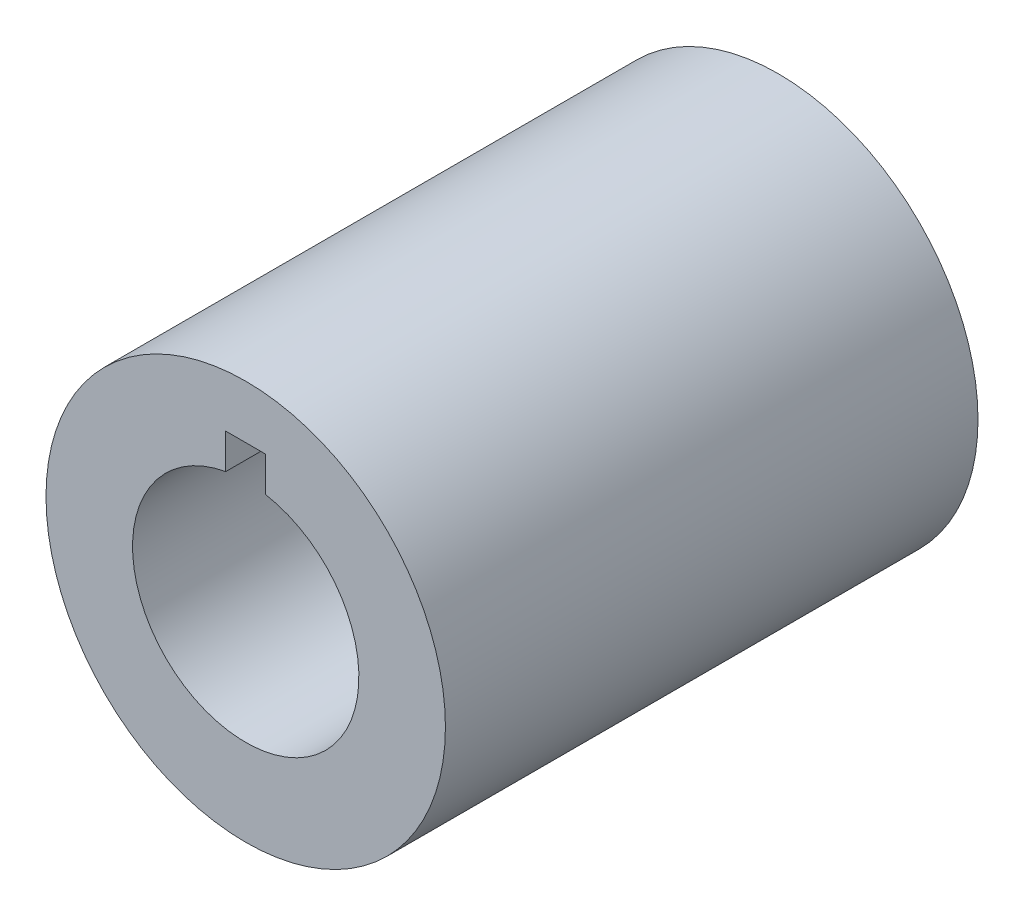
ISO-10303-21;
HEADER;
FILE_DESCRIPTION(('STEP AP214'),'2;1');
FILE_NAME('part.step','',(''),(''),'','','');
FILE_SCHEMA(('AUTOMOTIVE_DESIGN { 1 0 10303 214 1 1 1 1 }'));
ENDSEC;
DATA;
#1=APPLICATION_CONTEXT('core data for automotive mechanical design processes');
#2=APPLICATION_PROTOCOL_DEFINITION('international standard','automotive_design',2000,#1);
#3=PRODUCT_CONTEXT('',#1,'mechanical');
#4=PRODUCT('Part','Part','',(#3));
#5=PRODUCT_RELATED_PRODUCT_CATEGORY('part','',(#4));
#6=PRODUCT_DEFINITION_FORMATION('','',#4);
#7=PRODUCT_DEFINITION_CONTEXT('part definition',#1,'design');
#8=PRODUCT_DEFINITION('design','',#6,#7);
#9=PRODUCT_DEFINITION_SHAPE('','',#8);
#10=(LENGTH_UNIT() NAMED_UNIT(*) SI_UNIT(.MILLI.,.METRE.));
#11=(NAMED_UNIT(*) PLANE_ANGLE_UNIT() SI_UNIT($,.RADIAN.));
#12=(NAMED_UNIT(*) SI_UNIT($,.STERADIAN.) SOLID_ANGLE_UNIT());
#13=UNCERTAINTY_MEASURE_WITH_UNIT(LENGTH_MEASURE(1.E-05),#10,'distance_accuracy_value','');
#14=(GEOMETRIC_REPRESENTATION_CONTEXT(3) GLOBAL_UNCERTAINTY_ASSIGNED_CONTEXT((#13)) GLOBAL_UNIT_ASSIGNED_CONTEXT((#10,
#11,#12)) REPRESENTATION_CONTEXT('',''));
#15=CARTESIAN_POINT('',(0.,0.,0.));
#16=DIRECTION('',(0.,0.,1.));
#17=DIRECTION('',(1.,0.,0.));
#18=AXIS2_PLACEMENT_3D('',#15,#16,#17);
#19=CARTESIAN_POINT('',(0.,0.,40.));
#20=DIRECTION('',(0.,0.,1.));
#21=DIRECTION('',(1.,0.,0.));
#22=AXIS2_PLACEMENT_3D('',#19,#20,#21);
#23=PLANE('',#22);
#24=CARTESIAN_POINT('',(0.,0.,40.));
#25=DIRECTION('',(0.,0.,1.));
#26=DIRECTION('',(1.,0.,0.));
#27=AXIS2_PLACEMENT_3D('',#24,#25,#26);
#28=CIRCLE('',#27,15.);
#29=CARTESIAN_POINT('',(15.,0.,40.));
#30=VERTEX_POINT('',#29);
#31=EDGE_CURVE('E11',#30,#30,#28,.T.);
#32=ORIENTED_EDGE('',*,*,#31,.T.);
#33=EDGE_LOOP('',(#32));
#34=FACE_BOUND('',#33,.T.);
#35=DIRECTION('',(-1.,0.,0.));
#36=VECTOR('',#35,1.);
#37=CARTESIAN_POINT('',(-1.5,11.,40.));
#38=LINE('',#37,#36);
#39=CARTESIAN_POINT('',(1.5,11.,40.));
#40=VERTEX_POINT('',#39);
#41=CARTESIAN_POINT('',(-1.5,11.,40.));
#42=VERTEX_POINT('',#41);
#43=EDGE_CURVE('E81',#40,#42,#38,.T.);
#44=ORIENTED_EDGE('',*,*,#43,.F.);
#45=DIRECTION('',(0.,1.,0.));
#46=VECTOR('',#45,1.);
#47=CARTESIAN_POINT('',(1.5,8.36660026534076,40.));
#48=LINE('',#47,#46);
#49=CARTESIAN_POINT('',(1.5,8.36660026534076,40.));
#50=VERTEX_POINT('',#49);
#51=EDGE_CURVE('E73',#50,#40,#48,.T.);
#52=ORIENTED_EDGE('',*,*,#51,.F.);
#53=CARTESIAN_POINT('',(0.,0.,40.));
#54=DIRECTION('',(0.,0.,1.));
#55=DIRECTION('',(1.,0.,0.));
#56=AXIS2_PLACEMENT_3D('',#53,#54,#55);
#57=CIRCLE('',#56,8.5);
#58=CARTESIAN_POINT('',(-1.5,8.36660026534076,40.));
#59=VERTEX_POINT('',#58);
#60=EDGE_CURVE('E94',#59,#50,#57,.T.);
#61=ORIENTED_EDGE('',*,*,#60,.F.);
#62=DIRECTION('',(0.,-1.,0.));
#63=VECTOR('',#62,1.);
#64=CARTESIAN_POINT('',(-1.5,8.36660026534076,40.));
#65=LINE('',#64,#63);
#66=EDGE_CURVE('E92',#42,#59,#65,.T.);
#67=ORIENTED_EDGE('',*,*,#66,.F.);
#68=EDGE_LOOP('',(#44,#52,#61,#67));
#69=FACE_BOUND('',#68,.T.);
#70=ADVANCED_FACE('F32',(#34,#69),#23,.T.);
#71=CARTESIAN_POINT('',(0.,0.,0.));
#72=DIRECTION('',(0.,0.,1.));
#73=DIRECTION('',(1.,0.,0.));
#74=AXIS2_PLACEMENT_3D('',#71,#72,#73);
#75=PLANE('',#74);
#76=CARTESIAN_POINT('',(0.,0.,0.));
#77=DIRECTION('',(0.,0.,1.));
#78=DIRECTION('',(1.,0.,0.));
#79=AXIS2_PLACEMENT_3D('',#76,#77,#78);
#80=CIRCLE('',#79,15.);
#81=CARTESIAN_POINT('',(15.,0.,0.));
#82=VERTEX_POINT('',#81);
#83=EDGE_CURVE('E36',#82,#82,#80,.T.);
#84=ORIENTED_EDGE('',*,*,#83,.F.);
#85=EDGE_LOOP('',(#84));
#86=FACE_BOUND('',#85,.T.);
#87=DIRECTION('',(0.,1.,0.));
#88=VECTOR('',#87,1.);
#89=CARTESIAN_POINT('',(1.5,8.36660026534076,0.));
#90=LINE('',#89,#88);
#91=CARTESIAN_POINT('',(1.5,8.36660026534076,0.));
#92=VERTEX_POINT('',#91);
#93=CARTESIAN_POINT('',(1.5,11.,0.));
#94=VERTEX_POINT('',#93);
#95=EDGE_CURVE('E55',#92,#94,#90,.T.);
#96=ORIENTED_EDGE('',*,*,#95,.T.);
#97=DIRECTION('',(-1.,0.,0.));
#98=VECTOR('',#97,1.);
#99=CARTESIAN_POINT('',(-1.5,11.,0.));
#100=LINE('',#99,#98);
#101=CARTESIAN_POINT('',(-1.5,11.,0.));
#102=VERTEX_POINT('',#101);
#103=EDGE_CURVE('E88',#94,#102,#100,.T.);
#104=ORIENTED_EDGE('',*,*,#103,.T.);
#105=DIRECTION('',(0.,-1.,0.));
#106=VECTOR('',#105,1.);
#107=CARTESIAN_POINT('',(-1.5,8.36660026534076,0.));
#108=LINE('',#107,#106);
#109=CARTESIAN_POINT('',(-1.5,8.36660026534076,0.));
#110=VERTEX_POINT('',#109);
#111=EDGE_CURVE('E100',#102,#110,#108,.T.);
#112=ORIENTED_EDGE('',*,*,#111,.T.);
#113=CARTESIAN_POINT('',(0.,0.,0.));
#114=DIRECTION('',(0.,0.,1.));
#115=DIRECTION('',(1.,0.,0.));
#116=AXIS2_PLACEMENT_3D('',#113,#114,#115);
#117=CIRCLE('',#116,8.5);
#118=EDGE_CURVE('E82',#110,#92,#117,.T.);
#119=ORIENTED_EDGE('',*,*,#118,.T.);
#120=EDGE_LOOP('',(#96,#104,#112,#119));
#121=FACE_BOUND('',#120,.T.);
#122=ADVANCED_FACE('F111',(#86,#121),#75,.F.);
#123=CARTESIAN_POINT('',(0.,0.,40.));
#124=DIRECTION('',(0.,0.,-1.));
#125=DIRECTION('',(-1.,0.,0.));
#126=AXIS2_PLACEMENT_3D('',#123,#124,#125);
#127=CYLINDRICAL_SURFACE('',#126,15.);
#128=ORIENTED_EDGE('',*,*,#31,.F.);
#129=EDGE_LOOP('',(#128));
#130=FACE_BOUND('',#129,.T.);
#131=ORIENTED_EDGE('',*,*,#83,.T.);
#132=EDGE_LOOP('',(#131));
#133=FACE_BOUND('',#132,.T.);
#134=ADVANCED_FACE('F34',(#130,#133),#127,.T.);
#135=CARTESIAN_POINT('',(1.5,8.36660026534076,40.));
#136=DIRECTION('',(-1.,0.,0.));
#137=DIRECTION('',(0.,0.,1.));
#138=AXIS2_PLACEMENT_3D('',#135,#136,#137);
#139=PLANE('',#138);
#140=ORIENTED_EDGE('',*,*,#95,.F.);
#141=DIRECTION('',(0.,0.,-1.));
#142=VECTOR('',#141,1.);
#143=CARTESIAN_POINT('',(1.5,8.36660026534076,40.));
#144=LINE('',#143,#142);
#145=EDGE_CURVE('E77',#50,#92,#144,.T.);
#146=ORIENTED_EDGE('',*,*,#145,.F.);
#147=ORIENTED_EDGE('',*,*,#51,.T.);
#148=DIRECTION('',(0.,0.,-1.));
#149=VECTOR('',#148,1.);
#150=CARTESIAN_POINT('',(1.5,11.,40.));
#151=LINE('',#150,#149);
#152=EDGE_CURVE('E76',#40,#94,#151,.T.);
#153=ORIENTED_EDGE('',*,*,#152,.T.);
#154=EDGE_LOOP('',(#140,#146,#147,#153));
#155=FACE_BOUND('',#154,.T.);
#156=ADVANCED_FACE('F75',(#155),#139,.T.);
#157=CARTESIAN_POINT('',(-1.5,11.,40.));
#158=DIRECTION('',(0.,-1.,0.));
#159=DIRECTION('',(0.,0.,-1.));
#160=AXIS2_PLACEMENT_3D('',#157,#158,#159);
#161=PLANE('',#160);
#162=ORIENTED_EDGE('',*,*,#103,.F.);
#163=ORIENTED_EDGE('',*,*,#152,.F.);
#164=ORIENTED_EDGE('',*,*,#43,.T.);
#165=DIRECTION('',(0.,0.,-1.));
#166=VECTOR('',#165,1.);
#167=CARTESIAN_POINT('',(-1.5,11.,40.));
#168=LINE('',#167,#166);
#169=EDGE_CURVE('E89',#42,#102,#168,.T.);
#170=ORIENTED_EDGE('',*,*,#169,.T.);
#171=EDGE_LOOP('',(#162,#163,#164,#170));
#172=FACE_BOUND('',#171,.T.);
#173=ADVANCED_FACE('F85',(#172),#161,.T.);
#174=CARTESIAN_POINT('',(-1.5,8.36660026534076,40.));
#175=DIRECTION('',(1.,0.,0.));
#176=DIRECTION('',(0.,0.,-1.));
#177=AXIS2_PLACEMENT_3D('',#174,#175,#176);
#178=PLANE('',#177);
#179=ORIENTED_EDGE('',*,*,#111,.F.);
#180=ORIENTED_EDGE('',*,*,#169,.F.);
#181=ORIENTED_EDGE('',*,*,#66,.T.);
#182=DIRECTION('',(0.,0.,-1.));
#183=VECTOR('',#182,1.);
#184=CARTESIAN_POINT('',(-1.5,8.36660026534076,40.));
#185=LINE('',#184,#183);
#186=EDGE_CURVE('E47',#59,#110,#185,.T.);
#187=ORIENTED_EDGE('',*,*,#186,.T.);
#188=EDGE_LOOP('',(#179,#180,#181,#187));
#189=FACE_BOUND('',#188,.T.);
#190=ADVANCED_FACE('F109',(#189),#178,.T.);
#191=CARTESIAN_POINT('',(0.,0.,40.));
#192=DIRECTION('',(0.,0.,-1.));
#193=DIRECTION('',(-1.,0.,0.));
#194=AXIS2_PLACEMENT_3D('',#191,#192,#193);
#195=CYLINDRICAL_SURFACE('',#194,8.5);
#196=ORIENTED_EDGE('',*,*,#118,.F.);
#197=ORIENTED_EDGE('',*,*,#186,.F.);
#198=ORIENTED_EDGE('',*,*,#60,.T.);
#199=ORIENTED_EDGE('',*,*,#145,.T.);
#200=EDGE_LOOP('',(#196,#197,#198,#199));
#201=FACE_BOUND('',#200,.T.);
#202=ADVANCED_FACE('F112',(#201),#195,.F.);
#203=CLOSED_SHELL('',(#70,#122,#134,#156,#173,#190,#202));
#204=MANIFOLD_SOLID_BREP('B2',#203);
#205=ADVANCED_BREP_SHAPE_REPRESENTATION('',(#18,#204),#14);
#206=SHAPE_DEFINITION_REPRESENTATION(#9,#205);
ENDSEC;
END-ISO-10303-21;
